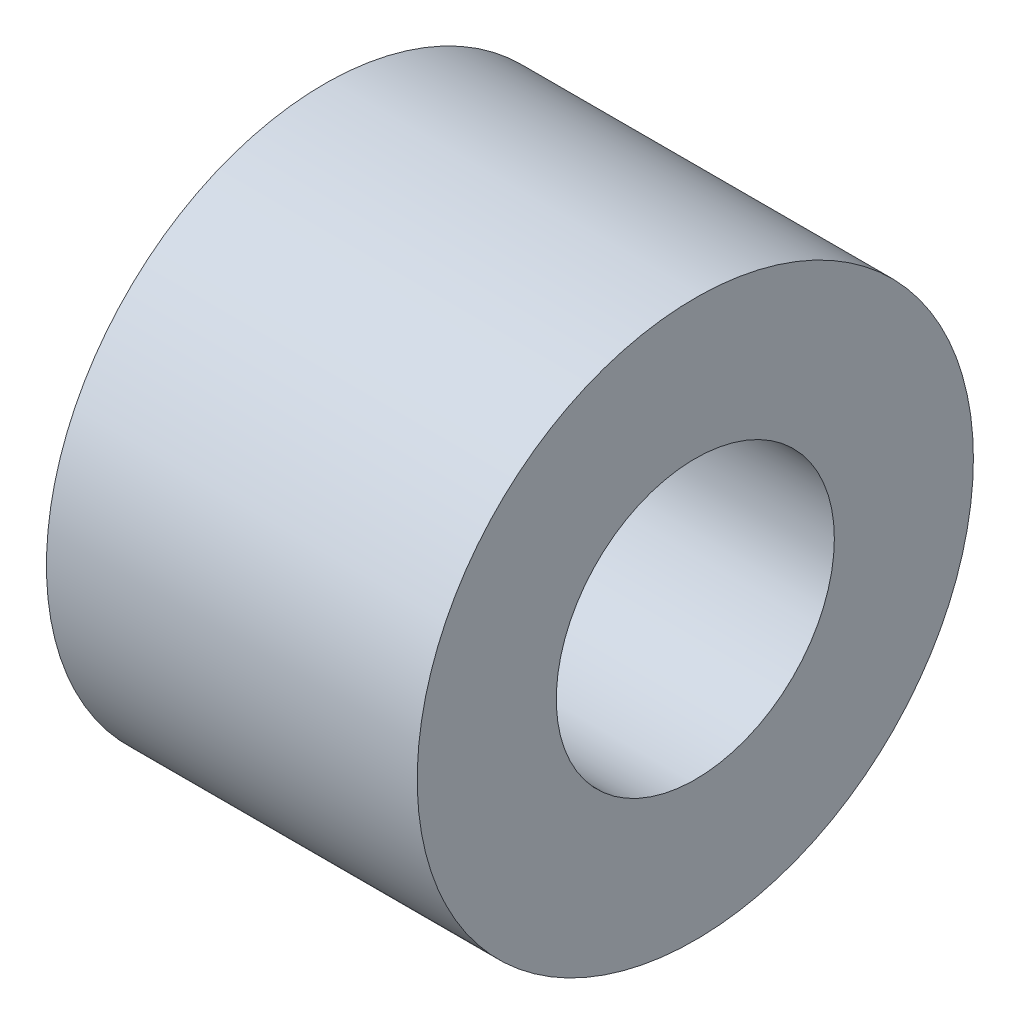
ISO-10303-21;
HEADER;
FILE_DESCRIPTION(('STEP AP214'),'2;1');
FILE_NAME('part.step','',(''),(''),'','','');
FILE_SCHEMA(('AUTOMOTIVE_DESIGN { 1 0 10303 214 1 1 1 1 }'));
ENDSEC;
DATA;
#1=APPLICATION_CONTEXT('core data for automotive mechanical design processes');
#2=APPLICATION_PROTOCOL_DEFINITION('international standard','automotive_design',2000,#1);
#3=PRODUCT_CONTEXT('',#1,'mechanical');
#4=PRODUCT('Part','Part','',(#3));
#5=PRODUCT_RELATED_PRODUCT_CATEGORY('part','',(#4));
#6=PRODUCT_DEFINITION_FORMATION('','',#4);
#7=PRODUCT_DEFINITION_CONTEXT('part definition',#1,'design');
#8=PRODUCT_DEFINITION('design','',#6,#7);
#9=PRODUCT_DEFINITION_SHAPE('','',#8);
#10=(LENGTH_UNIT() NAMED_UNIT(*) SI_UNIT(.MILLI.,.METRE.));
#11=(NAMED_UNIT(*) PLANE_ANGLE_UNIT() SI_UNIT($,.RADIAN.));
#12=(NAMED_UNIT(*) SI_UNIT($,.STERADIAN.) SOLID_ANGLE_UNIT());
#13=UNCERTAINTY_MEASURE_WITH_UNIT(LENGTH_MEASURE(1.E-05),#10,'distance_accuracy_value','');
#14=(GEOMETRIC_REPRESENTATION_CONTEXT(3) GLOBAL_UNCERTAINTY_ASSIGNED_CONTEXT((#13)) GLOBAL_UNIT_ASSIGNED_CONTEXT((#10,
#11,#12)) REPRESENTATION_CONTEXT('',''));
#15=CARTESIAN_POINT('',(0.,0.,0.));
#16=DIRECTION('',(0.,0.,1.));
#17=DIRECTION('',(1.,0.,0.));
#18=AXIS2_PLACEMENT_3D('',#15,#16,#17);
#19=CARTESIAN_POINT('',(3.175,0.,0.));
#20=DIRECTION('',(-1.,0.,0.));
#21=DIRECTION('',(0.,0.,1.));
#22=AXIS2_PLACEMENT_3D('',#19,#20,#21);
#23=CYLINDRICAL_SURFACE('',#22,2.38125);
#24=CARTESIAN_POINT('',(3.175,0.,0.));
#25=DIRECTION('',(1.,0.,0.));
#26=DIRECTION('',(0.,0.,-1.));
#27=AXIS2_PLACEMENT_3D('',#24,#25,#26);
#28=CIRCLE('',#27,2.38125);
#29=CARTESIAN_POINT('',(3.175,0.,-2.38125));
#30=VERTEX_POINT('',#29);
#31=EDGE_CURVE('E10',#30,#30,#28,.T.);
#32=ORIENTED_EDGE('',*,*,#31,.F.);
#33=EDGE_LOOP('',(#32));
#34=FACE_BOUND('',#33,.T.);
#35=CARTESIAN_POINT('',(0.,0.,0.));
#36=DIRECTION('',(1.,0.,0.));
#37=DIRECTION('',(0.,0.,-1.));
#38=AXIS2_PLACEMENT_3D('',#35,#36,#37);
#39=CIRCLE('',#38,2.38125);
#40=CARTESIAN_POINT('',(0.,0.,-2.38125));
#41=VERTEX_POINT('',#40);
#42=EDGE_CURVE('E32',#41,#41,#39,.T.);
#43=ORIENTED_EDGE('',*,*,#42,.T.);
#44=EDGE_LOOP('',(#43));
#45=FACE_BOUND('',#44,.T.);
#46=ADVANCED_FACE('F29',(#34,#45),#23,.T.);
#47=CARTESIAN_POINT('',(3.175,0.,0.));
#48=DIRECTION('',(1.,0.,0.));
#49=DIRECTION('',(0.,0.,-1.));
#50=AXIS2_PLACEMENT_3D('',#47,#48,#49);
#51=PLANE('',#50);
#52=CARTESIAN_POINT('',(3.175,0.,0.));
#53=DIRECTION('',(1.,0.,0.));
#54=DIRECTION('',(0.,0.,-1.));
#55=AXIS2_PLACEMENT_3D('',#52,#53,#54);
#56=CIRCLE('',#55,1.190625);
#57=CARTESIAN_POINT('',(3.175,0.,-1.190625));
#58=VERTEX_POINT('',#57);
#59=EDGE_CURVE('E41',#58,#58,#56,.T.);
#60=ORIENTED_EDGE('',*,*,#59,.F.);
#61=EDGE_LOOP('',(#60));
#62=FACE_BOUND('',#61,.T.);
#63=ORIENTED_EDGE('',*,*,#31,.T.);
#64=EDGE_LOOP('',(#63));
#65=FACE_BOUND('',#64,.T.);
#66=ADVANCED_FACE('F56',(#62,#65),#51,.T.);
#67=CARTESIAN_POINT('',(0.,0.,0.));
#68=DIRECTION('',(1.,0.,0.));
#69=DIRECTION('',(0.,0.,-1.));
#70=AXIS2_PLACEMENT_3D('',#67,#68,#69);
#71=PLANE('',#70);
#72=CARTESIAN_POINT('',(0.,0.,0.));
#73=DIRECTION('',(1.,0.,0.));
#74=DIRECTION('',(0.,0.,-1.));
#75=AXIS2_PLACEMENT_3D('',#72,#73,#74);
#76=CIRCLE('',#75,1.190625);
#77=CARTESIAN_POINT('',(0.,0.,-1.190625));
#78=VERTEX_POINT('',#77);
#79=EDGE_CURVE('E39',#78,#78,#76,.T.);
#80=ORIENTED_EDGE('',*,*,#79,.T.);
#81=EDGE_LOOP('',(#80));
#82=FACE_BOUND('',#81,.T.);
#83=ORIENTED_EDGE('',*,*,#42,.F.);
#84=EDGE_LOOP('',(#83));
#85=FACE_BOUND('',#84,.T.);
#86=ADVANCED_FACE('F47',(#82,#85),#71,.F.);
#87=CARTESIAN_POINT('',(0.,0.,0.));
#88=DIRECTION('',(1.,0.,0.));
#89=DIRECTION('',(0.,0.,-1.));
#90=AXIS2_PLACEMENT_3D('',#87,#88,#89);
#91=CYLINDRICAL_SURFACE('',#90,1.190625);
#92=ORIENTED_EDGE('',*,*,#79,.F.);
#93=EDGE_LOOP('',(#92));
#94=FACE_BOUND('',#93,.T.);
#95=ORIENTED_EDGE('',*,*,#59,.T.);
#96=EDGE_LOOP('',(#95));
#97=FACE_BOUND('',#96,.T.);
#98=ADVANCED_FACE('F50',(#94,#97),#91,.F.);
#99=CLOSED_SHELL('',(#46,#66,#86,#98));
#100=MANIFOLD_SOLID_BREP('B2',#99);
#101=ADVANCED_BREP_SHAPE_REPRESENTATION('',(#18,#100),#14);
#102=SHAPE_DEFINITION_REPRESENTATION(#9,#101);
ENDSEC;
END-ISO-10303-21;
